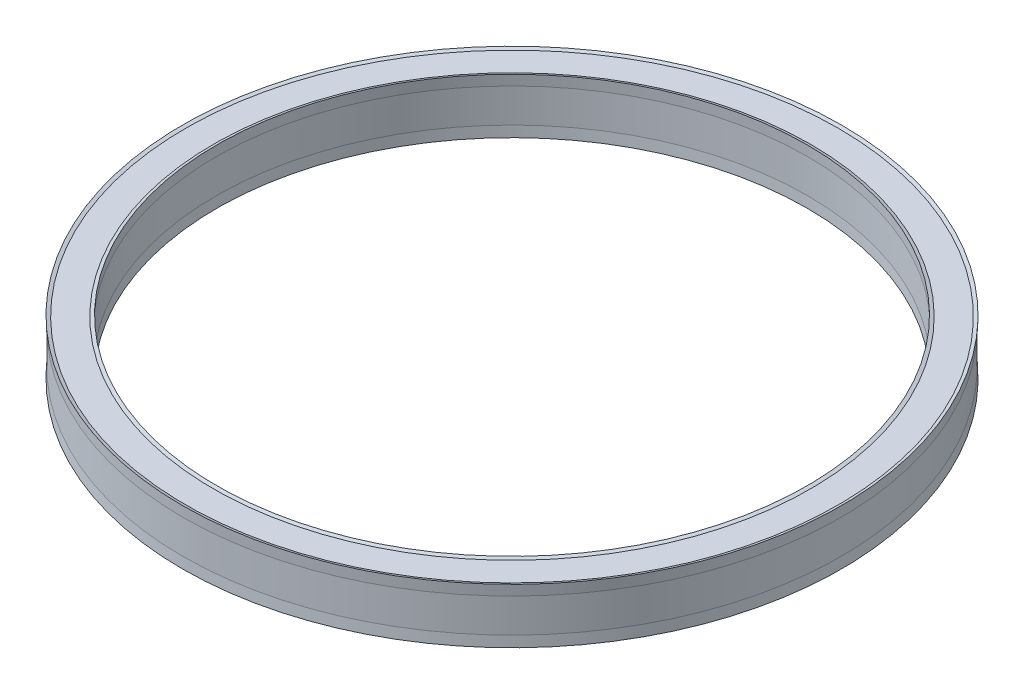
from build123d import *


with BuildPart() as part:
    # Sketch1 → Revolve1 (revolve)
    with BuildSketch(Plane.XY, mode=Mode.PRIVATE) as revolve1_sk:
        Polygon((34.13125, 6.35), (34.19475, 5.1308), (34.19475, 1.2192), (34.13125, 0), (34.51225, 0.127), (37.719, 0.127), (38.1, 0), (38.0365, 1.2192), (38.0365, 5.1308), (38.1, 6.35), (37.719, 6.223), (34.51225, 6.223), align=None)
    revolve(revolve1_sk.sketch.rotate(Axis((0, 0, 0), (0, 1, 0)), 90), axis=Axis((0, 0, 0), (0, 1, 0)))


solid = part.part
